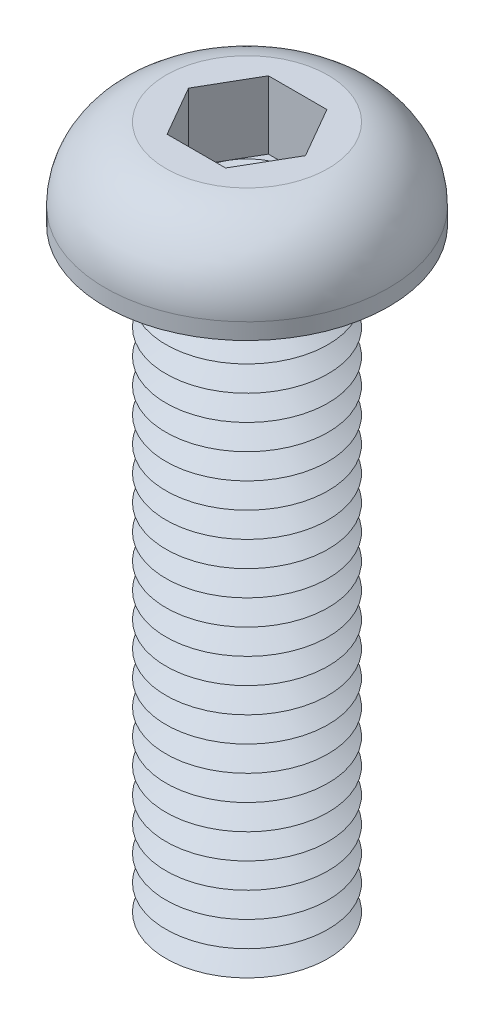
ISO-10303-21;
HEADER;
FILE_DESCRIPTION(('STEP AP214'),'2;1');
FILE_NAME('part.step','',(''),(''),'','','');
FILE_SCHEMA(('AUTOMOTIVE_DESIGN { 1 0 10303 214 1 1 1 1 }'));
ENDSEC;
DATA;
#1=APPLICATION_CONTEXT('core data for automotive mechanical design processes');
#2=APPLICATION_PROTOCOL_DEFINITION('international standard','automotive_design',2000,#1);
#3=PRODUCT_CONTEXT('',#1,'mechanical');
#4=PRODUCT('Part','Part','',(#3));
#5=PRODUCT_RELATED_PRODUCT_CATEGORY('part','',(#4));
#6=PRODUCT_DEFINITION_FORMATION('','',#4);
#7=PRODUCT_DEFINITION_CONTEXT('part definition',#1,'design');
#8=PRODUCT_DEFINITION('design','',#6,#7);
#9=PRODUCT_DEFINITION_SHAPE('','',#8);
#10=(LENGTH_UNIT() NAMED_UNIT(*) SI_UNIT(.MILLI.,.METRE.));
#11=(NAMED_UNIT(*) PLANE_ANGLE_UNIT() SI_UNIT($,.RADIAN.));
#12=(NAMED_UNIT(*) SI_UNIT($,.STERADIAN.) SOLID_ANGLE_UNIT());
#13=UNCERTAINTY_MEASURE_WITH_UNIT(LENGTH_MEASURE(1.E-05),#10,'distance_accuracy_value','');
#14=(GEOMETRIC_REPRESENTATION_CONTEXT(3) GLOBAL_UNCERTAINTY_ASSIGNED_CONTEXT((#13)) GLOBAL_UNIT_ASSIGNED_CONTEXT((#10,
#11,#12)) REPRESENTATION_CONTEXT('',''));
#15=CARTESIAN_POINT('',(0.,0.,0.));
#16=DIRECTION('',(0.,0.,1.));
#17=DIRECTION('',(1.,0.,0.));
#18=AXIS2_PLACEMENT_3D('',#15,#16,#17);
#19=CARTESIAN_POINT('',(0.,0.,0.));
#20=DIRECTION('',(0.,-1.,0.));
#21=DIRECTION('',(0.,0.,-1.));
#22=AXIS2_PLACEMENT_3D('',#19,#20,#21);
#23=TOROIDAL_SURFACE('',#22,4.625,0.625);
#24=CARTESIAN_POINT('',(0.,0.,-5.25));
#25=VERTEX_POINT('',#24);
#26=VERTEX_LOOP('',#25);
#27=FACE_BOUND('',#26,.T.);
#28=ADVANCED_FACE('P0_F12',(#27),#23,.T.);
#29=CLOSED_SHELL('',(#28));
#30=MANIFOLD_SOLID_BREP('P0_B1',#29);
#31=CARTESIAN_POINT('',(1.44337567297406,1.05,-2.5));
#32=DIRECTION('',(0.,1.,0.));
#33=DIRECTION('',(0.,0.,1.));
#34=AXIS2_PLACEMENT_3D('',#31,#32,#33);
#35=PLANE('',#34);
#36=CARTESIAN_POINT('',(0.,1.05,0.));
#37=DIRECTION('',(0.,1.,0.));
#38=DIRECTION('',(0.,0.,1.));
#39=AXIS2_PLACEMENT_3D('',#36,#37,#38);
#40=CIRCLE('',#39,2.5);
#41=CARTESIAN_POINT('',(0.,1.05,2.5));
#42=VERTEX_POINT('',#41);
#43=CARTESIAN_POINT('',(2.1650635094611,1.05,1.25));
#44=VERTEX_POINT('',#43);
#45=EDGE_CURVE('P1_E93',#42,#44,#40,.T.);
#46=ORIENTED_EDGE('',*,*,#45,.F.);
#47=DIRECTION('',(1.,0.,0.));
#48=VECTOR('',#47,1.);
#49=CARTESIAN_POINT('',(-1.44337567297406,1.05,2.5));
#50=LINE('',#49,#48);
#51=CARTESIAN_POINT('',(1.44337567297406,1.05,2.5));
#52=VERTEX_POINT('',#51);
#53=EDGE_CURVE('P1_E116',#42,#52,#50,.T.);
#54=ORIENTED_EDGE('',*,*,#53,.T.);
#55=DIRECTION('',(0.5,0.,-0.866025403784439));
#56=VECTOR('',#55,1.);
#57=CARTESIAN_POINT('',(1.44337567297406,1.05,2.5));
#58=LINE('',#57,#56);
#59=EDGE_CURVE('P1_E112',#52,#44,#58,.T.);
#60=ORIENTED_EDGE('',*,*,#59,.T.);
#61=EDGE_LOOP('',(#46,#54,#60));
#62=FACE_BOUND('',#61,.T.);
#63=ADVANCED_FACE('P1_F15',(#62),#35,.T.);
#64=CARTESIAN_POINT('',(0.,1.05,0.));
#65=DIRECTION('',(0.,1.,0.));
#66=DIRECTION('',(0.,0.,1.));
#67=AXIS2_PLACEMENT_3D('',#64,#65,#66);
#68=CIRCLE('',#67,2.5);
#69=CARTESIAN_POINT('',(2.1650635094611,1.05,-1.25));
#70=VERTEX_POINT('',#69);
#71=EDGE_CURVE('P1_E10',#44,#70,#68,.T.);
#72=ORIENTED_EDGE('',*,*,#71,.F.);
#73=CARTESIAN_POINT('',(2.88675134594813,1.05,0.));
#74=VERTEX_POINT('',#73);
#75=EDGE_CURVE('P1_E104',#44,#74,#58,.T.);
#76=ORIENTED_EDGE('',*,*,#75,.T.);
#77=DIRECTION('',(-0.5,0.,-0.866025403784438));
#78=VECTOR('',#77,1.);
#79=CARTESIAN_POINT('',(2.88675134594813,1.05,0.));
#80=LINE('',#79,#78);
#81=EDGE_CURVE('P1_E107',#74,#70,#80,.T.);
#82=ORIENTED_EDGE('',*,*,#81,.T.);
#83=EDGE_LOOP('',(#72,#76,#82));
#84=FACE_BOUND('',#83,.T.);
#85=ADVANCED_FACE('P1_F103',(#84),#35,.T.);
#86=CARTESIAN_POINT('',(0.,1.05,-2.5));
#87=VERTEX_POINT('',#86);
#88=EDGE_CURVE('P1_E24',#70,#87,#68,.T.);
#89=ORIENTED_EDGE('',*,*,#88,.F.);
#90=CARTESIAN_POINT('',(1.44337567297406,1.05,-2.5));
#91=VERTEX_POINT('',#90);
#92=EDGE_CURVE('P1_E139',#70,#91,#80,.T.);
#93=ORIENTED_EDGE('',*,*,#92,.T.);
#94=DIRECTION('',(-1.,0.,0.));
#95=VECTOR('',#94,1.);
#96=CARTESIAN_POINT('',(1.44337567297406,1.05,-2.5));
#97=LINE('',#96,#95);
#98=EDGE_CURVE('P1_E360',#91,#87,#97,.T.);
#99=ORIENTED_EDGE('',*,*,#98,.T.);
#100=EDGE_LOOP('',(#89,#93,#99));
#101=FACE_BOUND('',#100,.T.);
#102=ADVANCED_FACE('P1_F325',(#101),#35,.T.);
#103=CARTESIAN_POINT('',(-2.1650635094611,1.05,-1.25));
#104=VERTEX_POINT('',#103);
#105=EDGE_CURVE('P1_E355',#87,#104,#68,.T.);
#106=ORIENTED_EDGE('',*,*,#105,.F.);
#107=CARTESIAN_POINT('',(-1.44337567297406,1.05,-2.5));
#108=VERTEX_POINT('',#107);
#109=EDGE_CURVE('P1_E364',#87,#108,#97,.T.);
#110=ORIENTED_EDGE('',*,*,#109,.T.);
#111=DIRECTION('',(-0.5,0.,0.866025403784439));
#112=VECTOR('',#111,1.);
#113=CARTESIAN_POINT('',(-1.44337567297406,1.05,-2.5));
#114=LINE('',#113,#112);
#115=EDGE_CURVE('P1_E359',#108,#104,#114,.T.);
#116=ORIENTED_EDGE('',*,*,#115,.T.);
#117=EDGE_LOOP('',(#106,#110,#116));
#118=FACE_BOUND('',#117,.T.);
#119=ADVANCED_FACE('P1_F339',(#118),#35,.T.);
#120=CARTESIAN_POINT('',(-2.1650635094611,1.05,1.25));
#121=VERTEX_POINT('',#120);
#122=EDGE_CURVE('P1_E31',#104,#121,#68,.T.);
#123=ORIENTED_EDGE('',*,*,#122,.F.);
#124=CARTESIAN_POINT('',(-2.88675134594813,1.05,0.));
#125=VERTEX_POINT('',#124);
#126=EDGE_CURVE('P1_E351',#104,#125,#114,.T.);
#127=ORIENTED_EDGE('',*,*,#126,.T.);
#128=DIRECTION('',(0.5,0.,0.866025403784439));
#129=VECTOR('',#128,1.);
#130=CARTESIAN_POINT('',(-2.88675134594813,1.05,0.));
#131=LINE('',#130,#129);
#132=EDGE_CURVE('P1_E354',#125,#121,#131,.T.);
#133=ORIENTED_EDGE('',*,*,#132,.T.);
#134=EDGE_LOOP('',(#123,#127,#133));
#135=FACE_BOUND('',#134,.T.);
#136=ADVANCED_FACE('P1_F330',(#135),#35,.T.);
#137=CARTESIAN_POINT('',(0.,-28.75,0.));
#138=DIRECTION('',(0.,1.,0.));
#139=DIRECTION('',(0.,0.,1.));
#140=AXIS2_PLACEMENT_3D('',#137,#138,#139);
#141=CONICAL_SURFACE('',#140,2.91746824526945,1.0471975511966);
#142=CARTESIAN_POINT('',(0.,-28.125,0.));
#143=DIRECTION('',(0.,-1.,0.));
#144=DIRECTION('',(0.,0.,-1.));
#145=AXIS2_PLACEMENT_3D('',#142,#143,#144);
#146=CIRCLE('',#145,4.);
#147=CARTESIAN_POINT('',(0.,-28.125,-4.));
#148=VERTEX_POINT('',#147);
#149=EDGE_CURVE('P1_E287',#148,#148,#146,.T.);
#150=ORIENTED_EDGE('',*,*,#149,.T.);
#151=EDGE_LOOP('',(#150));
#152=FACE_BOUND('',#151,.T.);
#153=CARTESIAN_POINT('',(0.,-28.75,0.));
#154=DIRECTION('',(0.,-1.,0.));
#155=DIRECTION('',(0.,0.,-1.));
#156=AXIS2_PLACEMENT_3D('',#153,#154,#155);
#157=CIRCLE('',#156,2.91746824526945);
#158=CARTESIAN_POINT('',(0.,-28.75,-2.91746824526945));
#159=VERTEX_POINT('',#158);
#160=EDGE_CURVE('P1_E290',#159,#159,#157,.T.);
#161=ORIENTED_EDGE('',*,*,#160,.F.);
#162=EDGE_LOOP('',(#161));
#163=FACE_BOUND('',#162,.T.);
#164=ADVANCED_FACE('P1_F338',(#152,#163),#141,.T.);
#165=CARTESIAN_POINT('',(0.,-29.375,0.));
#166=DIRECTION('',(0.,-1.,0.));
#167=DIRECTION('',(0.,0.,-1.));
#168=AXIS2_PLACEMENT_3D('',#165,#166,#167);
#169=CONICAL_SURFACE('',#168,4.,1.0471975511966);
#170=ORIENTED_EDGE('',*,*,#160,.T.);
#171=EDGE_LOOP('',(#170));
#172=FACE_BOUND('',#171,.T.);
#173=CARTESIAN_POINT('',(0.,-29.375,0.));
#174=DIRECTION('',(0.,-1.,0.));
#175=DIRECTION('',(0.,0.,-1.));
#176=AXIS2_PLACEMENT_3D('',#173,#174,#175);
#177=CIRCLE('',#176,4.);
#178=CARTESIAN_POINT('',(0.,-29.375,-4.));
#179=VERTEX_POINT('',#178);
#180=EDGE_CURVE('P1_E293',#179,#179,#177,.T.);
#181=ORIENTED_EDGE('',*,*,#180,.F.);
#182=EDGE_LOOP('',(#181));
#183=FACE_BOUND('',#182,.T.);
#184=ADVANCED_FACE('P1_F345',(#172,#183),#169,.T.);
#185=CARTESIAN_POINT('',(0.,-30.,0.));
#186=DIRECTION('',(0.,1.,0.));
#187=DIRECTION('',(0.,0.,1.));
#188=AXIS2_PLACEMENT_3D('',#185,#186,#187);
#189=PLANE('',#188);
#190=CARTESIAN_POINT('',(0.,-30.,0.));
#191=DIRECTION('',(0.,-1.,0.));
#192=DIRECTION('',(0.,0.,-1.));
#193=AXIS2_PLACEMENT_3D('',#190,#191,#192);
#194=CIRCLE('',#193,2.91746824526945);
#195=CARTESIAN_POINT('',(0.,-30.,-2.91746824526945));
#196=VERTEX_POINT('',#195);
#197=EDGE_CURVE('P1_E296',#196,#196,#194,.T.);
#198=ORIENTED_EDGE('',*,*,#197,.T.);
#199=EDGE_LOOP('',(#198));
#200=FACE_BOUND('',#199,.T.);
#201=ADVANCED_FACE('P1_F423',(#200),#189,.F.);
#202=CARTESIAN_POINT('',(0.,-30.,0.));
#203=DIRECTION('',(0.,1.,0.));
#204=DIRECTION('',(0.,0.,1.));
#205=AXIS2_PLACEMENT_3D('',#202,#203,#204);
#206=CONICAL_SURFACE('',#205,2.91746824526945,1.0471975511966);
#207=ORIENTED_EDGE('',*,*,#180,.T.);
#208=EDGE_LOOP('',(#207));
#209=FACE_BOUND('',#208,.T.);
#210=ORIENTED_EDGE('',*,*,#197,.F.);
#211=EDGE_LOOP('',(#210));
#212=FACE_BOUND('',#211,.T.);
#213=ADVANCED_FACE('P1_F434',(#209,#212),#206,.T.);
#214=CARTESIAN_POINT('',(0.,-27.5,0.));
#215=DIRECTION('',(0.,1.,0.));
#216=DIRECTION('',(0.,0.,1.));
#217=AXIS2_PLACEMENT_3D('',#214,#215,#216);
#218=CONICAL_SURFACE('',#217,2.91746824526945,1.0471975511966);
#219=CARTESIAN_POINT('',(0.,-26.875,0.));
#220=DIRECTION('',(0.,-1.,0.));
#221=DIRECTION('',(0.,0.,-1.));
#222=AXIS2_PLACEMENT_3D('',#219,#220,#221);
#223=CIRCLE('',#222,4.);
#224=CARTESIAN_POINT('',(0.,-26.875,-4.));
#225=VERTEX_POINT('',#224);
#226=EDGE_CURVE('P1_E281',#225,#225,#223,.T.);
#227=ORIENTED_EDGE('',*,*,#226,.T.);
#228=EDGE_LOOP('',(#227));
#229=FACE_BOUND('',#228,.T.);
#230=CARTESIAN_POINT('',(0.,-27.5,0.));
#231=DIRECTION('',(0.,-1.,0.));
#232=DIRECTION('',(0.,0.,-1.));
#233=AXIS2_PLACEMENT_3D('',#230,#231,#232);
#234=CIRCLE('',#233,2.91746824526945);
#235=CARTESIAN_POINT('',(0.,-27.5,-2.91746824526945));
#236=VERTEX_POINT('',#235);
#237=EDGE_CURVE('P1_E284',#236,#236,#234,.T.);
#238=ORIENTED_EDGE('',*,*,#237,.F.);
#239=EDGE_LOOP('',(#238));
#240=FACE_BOUND('',#239,.T.);
#241=ADVANCED_FACE('P1_F443',(#229,#240),#218,.T.);
#242=CARTESIAN_POINT('',(0.,-28.125,0.));
#243=DIRECTION('',(0.,-1.,0.));
#244=DIRECTION('',(0.,0.,-1.));
#245=AXIS2_PLACEMENT_3D('',#242,#243,#244);
#246=CONICAL_SURFACE('',#245,4.,1.0471975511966);
#247=ORIENTED_EDGE('',*,*,#237,.T.);
#248=EDGE_LOOP('',(#247));
#249=FACE_BOUND('',#248,.T.);
#250=ORIENTED_EDGE('',*,*,#149,.F.);
#251=EDGE_LOOP('',(#250));
#252=FACE_BOUND('',#251,.T.);
#253=ADVANCED_FACE('P1_F452',(#249,#252),#246,.T.);
#254=CARTESIAN_POINT('',(0.,-26.25,0.));
#255=DIRECTION('',(0.,1.,0.));
#256=DIRECTION('',(0.,0.,1.));
#257=AXIS2_PLACEMENT_3D('',#254,#255,#256);
#258=CONICAL_SURFACE('',#257,2.91746824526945,1.0471975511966);
#259=CARTESIAN_POINT('',(0.,-25.625,0.));
#260=DIRECTION('',(0.,-1.,0.));
#261=DIRECTION('',(0.,0.,-1.));
#262=AXIS2_PLACEMENT_3D('',#259,#260,#261);
#263=CIRCLE('',#262,4.);
#264=CARTESIAN_POINT('',(0.,-25.625,-4.));
#265=VERTEX_POINT('',#264);
#266=EDGE_CURVE('P1_E275',#265,#265,#263,.T.);
#267=ORIENTED_EDGE('',*,*,#266,.T.);
#268=EDGE_LOOP('',(#267));
#269=FACE_BOUND('',#268,.T.);
#270=CARTESIAN_POINT('',(0.,-26.25,0.));
#271=DIRECTION('',(0.,-1.,0.));
#272=DIRECTION('',(0.,0.,-1.));
#273=AXIS2_PLACEMENT_3D('',#270,#271,#272);
#274=CIRCLE('',#273,2.91746824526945);
#275=CARTESIAN_POINT('',(0.,-26.25,-2.91746824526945));
#276=VERTEX_POINT('',#275);
#277=EDGE_CURVE('P1_E278',#276,#276,#274,.T.);
#278=ORIENTED_EDGE('',*,*,#277,.F.);
#279=EDGE_LOOP('',(#278));
#280=FACE_BOUND('',#279,.T.);
#281=ADVANCED_FACE('P1_F462',(#269,#280),#258,.T.);
#282=CARTESIAN_POINT('',(0.,-26.875,0.));
#283=DIRECTION('',(0.,-1.,0.));
#284=DIRECTION('',(0.,0.,-1.));
#285=AXIS2_PLACEMENT_3D('',#282,#283,#284);
#286=CONICAL_SURFACE('',#285,4.,1.0471975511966);
#287=ORIENTED_EDGE('',*,*,#277,.T.);
#288=EDGE_LOOP('',(#287));
#289=FACE_BOUND('',#288,.T.);
#290=ORIENTED_EDGE('',*,*,#226,.F.);
#291=EDGE_LOOP('',(#290));
#292=FACE_BOUND('',#291,.T.);
#293=ADVANCED_FACE('P1_F472',(#289,#292),#286,.T.);
#294=CARTESIAN_POINT('',(0.,-25.,0.));
#295=DIRECTION('',(0.,1.,0.));
#296=DIRECTION('',(0.,0.,1.));
#297=AXIS2_PLACEMENT_3D('',#294,#295,#296);
#298=CONICAL_SURFACE('',#297,2.91746824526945,1.0471975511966);
#299=CARTESIAN_POINT('',(0.,-24.375,0.));
#300=DIRECTION('',(0.,-1.,0.));
#301=DIRECTION('',(0.,0.,-1.));
#302=AXIS2_PLACEMENT_3D('',#299,#300,#301);
#303=CIRCLE('',#302,4.);
#304=CARTESIAN_POINT('',(0.,-24.375,-4.));
#305=VERTEX_POINT('',#304);
#306=EDGE_CURVE('P1_E269',#305,#305,#303,.T.);
#307=ORIENTED_EDGE('',*,*,#306,.T.);
#308=EDGE_LOOP('',(#307));
#309=FACE_BOUND('',#308,.T.);
#310=CARTESIAN_POINT('',(0.,-25.,0.));
#311=DIRECTION('',(0.,-1.,0.));
#312=DIRECTION('',(0.,0.,-1.));
#313=AXIS2_PLACEMENT_3D('',#310,#311,#312);
#314=CIRCLE('',#313,2.91746824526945);
#315=CARTESIAN_POINT('',(0.,-25.,-2.91746824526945));
#316=VERTEX_POINT('',#315);
#317=EDGE_CURVE('P1_E272',#316,#316,#314,.T.);
#318=ORIENTED_EDGE('',*,*,#317,.F.);
#319=EDGE_LOOP('',(#318));
#320=FACE_BOUND('',#319,.T.);
#321=ADVANCED_FACE('P1_F482',(#309,#320),#298,.T.);
#322=CARTESIAN_POINT('',(0.,-25.625,0.));
#323=DIRECTION('',(0.,-1.,0.));
#324=DIRECTION('',(0.,0.,-1.));
#325=AXIS2_PLACEMENT_3D('',#322,#323,#324);
#326=CONICAL_SURFACE('',#325,4.,1.0471975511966);
#327=ORIENTED_EDGE('',*,*,#317,.T.);
#328=EDGE_LOOP('',(#327));
#329=FACE_BOUND('',#328,.T.);
#330=ORIENTED_EDGE('',*,*,#266,.F.);
#331=EDGE_LOOP('',(#330));
#332=FACE_BOUND('',#331,.T.);
#333=ADVANCED_FACE('P1_F492',(#329,#332),#326,.T.);
#334=CARTESIAN_POINT('',(0.,-23.75,0.));
#335=DIRECTION('',(0.,1.,0.));
#336=DIRECTION('',(0.,0.,1.));
#337=AXIS2_PLACEMENT_3D('',#334,#335,#336);
#338=CONICAL_SURFACE('',#337,2.91746824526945,1.0471975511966);
#339=CARTESIAN_POINT('',(0.,-23.125,0.));
#340=DIRECTION('',(0.,-1.,0.));
#341=DIRECTION('',(0.,0.,-1.));
#342=AXIS2_PLACEMENT_3D('',#339,#340,#341);
#343=CIRCLE('',#342,4.);
#344=CARTESIAN_POINT('',(0.,-23.125,-4.));
#345=VERTEX_POINT('',#344);
#346=EDGE_CURVE('P1_E263',#345,#345,#343,.T.);
#347=ORIENTED_EDGE('',*,*,#346,.T.);
#348=EDGE_LOOP('',(#347));
#349=FACE_BOUND('',#348,.T.);
#350=CARTESIAN_POINT('',(0.,-23.75,0.));
#351=DIRECTION('',(0.,-1.,0.));
#352=DIRECTION('',(0.,0.,-1.));
#353=AXIS2_PLACEMENT_3D('',#350,#351,#352);
#354=CIRCLE('',#353,2.91746824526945);
#355=CARTESIAN_POINT('',(0.,-23.75,-2.91746824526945));
#356=VERTEX_POINT('',#355);
#357=EDGE_CURVE('P1_E266',#356,#356,#354,.T.);
#358=ORIENTED_EDGE('',*,*,#357,.F.);
#359=EDGE_LOOP('',(#358));
#360=FACE_BOUND('',#359,.T.);
#361=ADVANCED_FACE('P1_F502',(#349,#360),#338,.T.);
#362=CARTESIAN_POINT('',(0.,-24.375,0.));
#363=DIRECTION('',(0.,-1.,0.));
#364=DIRECTION('',(0.,0.,-1.));
#365=AXIS2_PLACEMENT_3D('',#362,#363,#364);
#366=CONICAL_SURFACE('',#365,4.,1.0471975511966);
#367=ORIENTED_EDGE('',*,*,#357,.T.);
#368=EDGE_LOOP('',(#367));
#369=FACE_BOUND('',#368,.T.);
#370=ORIENTED_EDGE('',*,*,#306,.F.);
#371=EDGE_LOOP('',(#370));
#372=FACE_BOUND('',#371,.T.);
#373=ADVANCED_FACE('P1_F512',(#369,#372),#366,.T.);
#374=CARTESIAN_POINT('',(0.,-22.5,0.));
#375=DIRECTION('',(0.,1.,0.));
#376=DIRECTION('',(0.,0.,1.));
#377=AXIS2_PLACEMENT_3D('',#374,#375,#376);
#378=CONICAL_SURFACE('',#377,2.91746824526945,1.0471975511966);
#379=CARTESIAN_POINT('',(0.,-21.875,0.));
#380=DIRECTION('',(0.,-1.,0.));
#381=DIRECTION('',(0.,0.,-1.));
#382=AXIS2_PLACEMENT_3D('',#379,#380,#381);
#383=CIRCLE('',#382,4.);
#384=CARTESIAN_POINT('',(0.,-21.875,-4.));
#385=VERTEX_POINT('',#384);
#386=EDGE_CURVE('P1_E257',#385,#385,#383,.T.);
#387=ORIENTED_EDGE('',*,*,#386,.T.);
#388=EDGE_LOOP('',(#387));
#389=FACE_BOUND('',#388,.T.);
#390=CARTESIAN_POINT('',(0.,-22.5,0.));
#391=DIRECTION('',(0.,-1.,0.));
#392=DIRECTION('',(0.,0.,-1.));
#393=AXIS2_PLACEMENT_3D('',#390,#391,#392);
#394=CIRCLE('',#393,2.91746824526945);
#395=CARTESIAN_POINT('',(0.,-22.5,-2.91746824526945));
#396=VERTEX_POINT('',#395);
#397=EDGE_CURVE('P1_E260',#396,#396,#394,.T.);
#398=ORIENTED_EDGE('',*,*,#397,.F.);
#399=EDGE_LOOP('',(#398));
#400=FACE_BOUND('',#399,.T.);
#401=ADVANCED_FACE('P1_F522',(#389,#400),#378,.T.);
#402=CARTESIAN_POINT('',(0.,-23.125,0.));
#403=DIRECTION('',(0.,-1.,0.));
#404=DIRECTION('',(0.,0.,-1.));
#405=AXIS2_PLACEMENT_3D('',#402,#403,#404);
#406=CONICAL_SURFACE('',#405,4.,1.0471975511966);
#407=ORIENTED_EDGE('',*,*,#397,.T.);
#408=EDGE_LOOP('',(#407));
#409=FACE_BOUND('',#408,.T.);
#410=ORIENTED_EDGE('',*,*,#346,.F.);
#411=EDGE_LOOP('',(#410));
#412=FACE_BOUND('',#411,.T.);
#413=ADVANCED_FACE('P1_F532',(#409,#412),#406,.T.);
#414=CARTESIAN_POINT('',(0.,-21.25,0.));
#415=DIRECTION('',(0.,1.,0.));
#416=DIRECTION('',(0.,0.,1.));
#417=AXIS2_PLACEMENT_3D('',#414,#415,#416);
#418=CONICAL_SURFACE('',#417,2.91746824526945,1.0471975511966);
#419=CARTESIAN_POINT('',(0.,-20.625,0.));
#420=DIRECTION('',(0.,-1.,0.));
#421=DIRECTION('',(0.,0.,-1.));
#422=AXIS2_PLACEMENT_3D('',#419,#420,#421);
#423=CIRCLE('',#422,4.);
#424=CARTESIAN_POINT('',(0.,-20.625,-4.));
#425=VERTEX_POINT('',#424);
#426=EDGE_CURVE('P1_E251',#425,#425,#423,.T.);
#427=ORIENTED_EDGE('',*,*,#426,.T.);
#428=EDGE_LOOP('',(#427));
#429=FACE_BOUND('',#428,.T.);
#430=CARTESIAN_POINT('',(0.,-21.25,0.));
#431=DIRECTION('',(0.,-1.,0.));
#432=DIRECTION('',(0.,0.,-1.));
#433=AXIS2_PLACEMENT_3D('',#430,#431,#432);
#434=CIRCLE('',#433,2.91746824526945);
#435=CARTESIAN_POINT('',(0.,-21.25,-2.91746824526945));
#436=VERTEX_POINT('',#435);
#437=EDGE_CURVE('P1_E254',#436,#436,#434,.T.);
#438=ORIENTED_EDGE('',*,*,#437,.F.);
#439=EDGE_LOOP('',(#438));
#440=FACE_BOUND('',#439,.T.);
#441=ADVANCED_FACE('P1_F542',(#429,#440),#418,.T.);
#442=CARTESIAN_POINT('',(0.,-21.875,0.));
#443=DIRECTION('',(0.,-1.,0.));
#444=DIRECTION('',(0.,0.,-1.));
#445=AXIS2_PLACEMENT_3D('',#442,#443,#444);
#446=CONICAL_SURFACE('',#445,4.,1.0471975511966);
#447=ORIENTED_EDGE('',*,*,#437,.T.);
#448=EDGE_LOOP('',(#447));
#449=FACE_BOUND('',#448,.T.);
#450=ORIENTED_EDGE('',*,*,#386,.F.);
#451=EDGE_LOOP('',(#450));
#452=FACE_BOUND('',#451,.T.);
#453=ADVANCED_FACE('P1_F552',(#449,#452),#446,.T.);
#454=CARTESIAN_POINT('',(0.,-20.,0.));
#455=DIRECTION('',(0.,1.,0.));
#456=DIRECTION('',(0.,0.,1.));
#457=AXIS2_PLACEMENT_3D('',#454,#455,#456);
#458=CONICAL_SURFACE('',#457,2.91746824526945,1.0471975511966);
#459=CARTESIAN_POINT('',(0.,-19.375,0.));
#460=DIRECTION('',(0.,-1.,0.));
#461=DIRECTION('',(0.,0.,-1.));
#462=AXIS2_PLACEMENT_3D('',#459,#460,#461);
#463=CIRCLE('',#462,4.);
#464=CARTESIAN_POINT('',(0.,-19.375,-4.));
#465=VERTEX_POINT('',#464);
#466=EDGE_CURVE('P1_E245',#465,#465,#463,.T.);
#467=ORIENTED_EDGE('',*,*,#466,.T.);
#468=EDGE_LOOP('',(#467));
#469=FACE_BOUND('',#468,.T.);
#470=CARTESIAN_POINT('',(0.,-20.,0.));
#471=DIRECTION('',(0.,-1.,0.));
#472=DIRECTION('',(0.,0.,-1.));
#473=AXIS2_PLACEMENT_3D('',#470,#471,#472);
#474=CIRCLE('',#473,2.91746824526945);
#475=CARTESIAN_POINT('',(0.,-20.,-2.91746824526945));
#476=VERTEX_POINT('',#475);
#477=EDGE_CURVE('P1_E248',#476,#476,#474,.T.);
#478=ORIENTED_EDGE('',*,*,#477,.F.);
#479=EDGE_LOOP('',(#478));
#480=FACE_BOUND('',#479,.T.);
#481=ADVANCED_FACE('P1_F562',(#469,#480),#458,.T.);
#482=CARTESIAN_POINT('',(0.,-20.625,0.));
#483=DIRECTION('',(0.,-1.,0.));
#484=DIRECTION('',(0.,0.,-1.));
#485=AXIS2_PLACEMENT_3D('',#482,#483,#484);
#486=CONICAL_SURFACE('',#485,4.,1.0471975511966);
#487=ORIENTED_EDGE('',*,*,#477,.T.);
#488=EDGE_LOOP('',(#487));
#489=FACE_BOUND('',#488,.T.);
#490=ORIENTED_EDGE('',*,*,#426,.F.);
#491=EDGE_LOOP('',(#490));
#492=FACE_BOUND('',#491,.T.);
#493=ADVANCED_FACE('P1_F572',(#489,#492),#486,.T.);
#494=CARTESIAN_POINT('',(0.,-18.75,0.));
#495=DIRECTION('',(0.,1.,0.));
#496=DIRECTION('',(0.,0.,1.));
#497=AXIS2_PLACEMENT_3D('',#494,#495,#496);
#498=CONICAL_SURFACE('',#497,2.91746824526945,1.0471975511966);
#499=CARTESIAN_POINT('',(0.,-18.125,0.));
#500=DIRECTION('',(0.,-1.,0.));
#501=DIRECTION('',(0.,0.,-1.));
#502=AXIS2_PLACEMENT_3D('',#499,#500,#501);
#503=CIRCLE('',#502,4.);
#504=CARTESIAN_POINT('',(0.,-18.125,-4.));
#505=VERTEX_POINT('',#504);
#506=EDGE_CURVE('P1_E239',#505,#505,#503,.T.);
#507=ORIENTED_EDGE('',*,*,#506,.T.);
#508=EDGE_LOOP('',(#507));
#509=FACE_BOUND('',#508,.T.);
#510=CARTESIAN_POINT('',(0.,-18.75,0.));
#511=DIRECTION('',(0.,-1.,0.));
#512=DIRECTION('',(0.,0.,-1.));
#513=AXIS2_PLACEMENT_3D('',#510,#511,#512);
#514=CIRCLE('',#513,2.91746824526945);
#515=CARTESIAN_POINT('',(0.,-18.75,-2.91746824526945));
#516=VERTEX_POINT('',#515);
#517=EDGE_CURVE('P1_E242',#516,#516,#514,.T.);
#518=ORIENTED_EDGE('',*,*,#517,.F.);
#519=EDGE_LOOP('',(#518));
#520=FACE_BOUND('',#519,.T.);
#521=ADVANCED_FACE('P1_F582',(#509,#520),#498,.T.);
#522=CARTESIAN_POINT('',(0.,-19.375,0.));
#523=DIRECTION('',(0.,-1.,0.));
#524=DIRECTION('',(0.,0.,-1.));
#525=AXIS2_PLACEMENT_3D('',#522,#523,#524);
#526=CONICAL_SURFACE('',#525,4.,1.0471975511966);
#527=ORIENTED_EDGE('',*,*,#517,.T.);
#528=EDGE_LOOP('',(#527));
#529=FACE_BOUND('',#528,.T.);
#530=ORIENTED_EDGE('',*,*,#466,.F.);
#531=EDGE_LOOP('',(#530));
#532=FACE_BOUND('',#531,.T.);
#533=ADVANCED_FACE('P1_F592',(#529,#532),#526,.T.);
#534=CARTESIAN_POINT('',(0.,-17.5,0.));
#535=DIRECTION('',(0.,1.,0.));
#536=DIRECTION('',(0.,0.,1.));
#537=AXIS2_PLACEMENT_3D('',#534,#535,#536);
#538=CONICAL_SURFACE('',#537,2.91746824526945,1.0471975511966);
#539=CARTESIAN_POINT('',(0.,-16.875,0.));
#540=DIRECTION('',(0.,-1.,0.));
#541=DIRECTION('',(0.,0.,-1.));
#542=AXIS2_PLACEMENT_3D('',#539,#540,#541);
#543=CIRCLE('',#542,4.);
#544=CARTESIAN_POINT('',(0.,-16.875,-4.));
#545=VERTEX_POINT('',#544);
#546=EDGE_CURVE('P1_E233',#545,#545,#543,.T.);
#547=ORIENTED_EDGE('',*,*,#546,.T.);
#548=EDGE_LOOP('',(#547));
#549=FACE_BOUND('',#548,.T.);
#550=CARTESIAN_POINT('',(0.,-17.5,0.));
#551=DIRECTION('',(0.,-1.,0.));
#552=DIRECTION('',(0.,0.,-1.));
#553=AXIS2_PLACEMENT_3D('',#550,#551,#552);
#554=CIRCLE('',#553,2.91746824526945);
#555=CARTESIAN_POINT('',(0.,-17.5,-2.91746824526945));
#556=VERTEX_POINT('',#555);
#557=EDGE_CURVE('P1_E236',#556,#556,#554,.T.);
#558=ORIENTED_EDGE('',*,*,#557,.F.);
#559=EDGE_LOOP('',(#558));
#560=FACE_BOUND('',#559,.T.);
#561=ADVANCED_FACE('P1_F602',(#549,#560),#538,.T.);
#562=CARTESIAN_POINT('',(0.,-18.125,0.));
#563=DIRECTION('',(0.,-1.,0.));
#564=DIRECTION('',(0.,0.,-1.));
#565=AXIS2_PLACEMENT_3D('',#562,#563,#564);
#566=CONICAL_SURFACE('',#565,4.,1.0471975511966);
#567=ORIENTED_EDGE('',*,*,#557,.T.);
#568=EDGE_LOOP('',(#567));
#569=FACE_BOUND('',#568,.T.);
#570=ORIENTED_EDGE('',*,*,#506,.F.);
#571=EDGE_LOOP('',(#570));
#572=FACE_BOUND('',#571,.T.);
#573=ADVANCED_FACE('P1_F612',(#569,#572),#566,.T.);
#574=CARTESIAN_POINT('',(0.,-16.25,0.));
#575=DIRECTION('',(0.,1.,0.));
#576=DIRECTION('',(0.,0.,1.));
#577=AXIS2_PLACEMENT_3D('',#574,#575,#576);
#578=CONICAL_SURFACE('',#577,2.91746824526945,1.0471975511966);
#579=CARTESIAN_POINT('',(0.,-15.625,0.));
#580=DIRECTION('',(0.,-1.,0.));
#581=DIRECTION('',(0.,0.,-1.));
#582=AXIS2_PLACEMENT_3D('',#579,#580,#581);
#583=CIRCLE('',#582,4.);
#584=CARTESIAN_POINT('',(0.,-15.625,-4.));
#585=VERTEX_POINT('',#584);
#586=EDGE_CURVE('P1_E227',#585,#585,#583,.T.);
#587=ORIENTED_EDGE('',*,*,#586,.T.);
#588=EDGE_LOOP('',(#587));
#589=FACE_BOUND('',#588,.T.);
#590=CARTESIAN_POINT('',(0.,-16.25,0.));
#591=DIRECTION('',(0.,-1.,0.));
#592=DIRECTION('',(0.,0.,-1.));
#593=AXIS2_PLACEMENT_3D('',#590,#591,#592);
#594=CIRCLE('',#593,2.91746824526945);
#595=CARTESIAN_POINT('',(0.,-16.25,-2.91746824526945));
#596=VERTEX_POINT('',#595);
#597=EDGE_CURVE('P1_E230',#596,#596,#594,.T.);
#598=ORIENTED_EDGE('',*,*,#597,.F.);
#599=EDGE_LOOP('',(#598));
#600=FACE_BOUND('',#599,.T.);
#601=ADVANCED_FACE('P1_F622',(#589,#600),#578,.T.);
#602=CARTESIAN_POINT('',(0.,-16.875,0.));
#603=DIRECTION('',(0.,-1.,0.));
#604=DIRECTION('',(0.,0.,-1.));
#605=AXIS2_PLACEMENT_3D('',#602,#603,#604);
#606=CONICAL_SURFACE('',#605,4.,1.0471975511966);
#607=ORIENTED_EDGE('',*,*,#597,.T.);
#608=EDGE_LOOP('',(#607));
#609=FACE_BOUND('',#608,.T.);
#610=ORIENTED_EDGE('',*,*,#546,.F.);
#611=EDGE_LOOP('',(#610));
#612=FACE_BOUND('',#611,.T.);
#613=ADVANCED_FACE('P1_F632',(#609,#612),#606,.T.);
#614=CARTESIAN_POINT('',(0.,-15.,0.));
#615=DIRECTION('',(0.,1.,0.));
#616=DIRECTION('',(0.,0.,1.));
#617=AXIS2_PLACEMENT_3D('',#614,#615,#616);
#618=CONICAL_SURFACE('',#617,2.91746824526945,1.0471975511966);
#619=CARTESIAN_POINT('',(0.,-14.375,0.));
#620=DIRECTION('',(0.,-1.,0.));
#621=DIRECTION('',(0.,0.,-1.));
#622=AXIS2_PLACEMENT_3D('',#619,#620,#621);
#623=CIRCLE('',#622,4.);
#624=CARTESIAN_POINT('',(0.,-14.375,-4.));
#625=VERTEX_POINT('',#624);
#626=EDGE_CURVE('P1_E221',#625,#625,#623,.T.);
#627=ORIENTED_EDGE('',*,*,#626,.T.);
#628=EDGE_LOOP('',(#627));
#629=FACE_BOUND('',#628,.T.);
#630=CARTESIAN_POINT('',(0.,-15.,0.));
#631=DIRECTION('',(0.,-1.,0.));
#632=DIRECTION('',(0.,0.,-1.));
#633=AXIS2_PLACEMENT_3D('',#630,#631,#632);
#634=CIRCLE('',#633,2.91746824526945);
#635=CARTESIAN_POINT('',(0.,-15.,-2.91746824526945));
#636=VERTEX_POINT('',#635);
#637=EDGE_CURVE('P1_E224',#636,#636,#634,.T.);
#638=ORIENTED_EDGE('',*,*,#637,.F.);
#639=EDGE_LOOP('',(#638));
#640=FACE_BOUND('',#639,.T.);
#641=ADVANCED_FACE('P1_F642',(#629,#640),#618,.T.);
#642=CARTESIAN_POINT('',(0.,-15.625,0.));
#643=DIRECTION('',(0.,-1.,0.));
#644=DIRECTION('',(0.,0.,-1.));
#645=AXIS2_PLACEMENT_3D('',#642,#643,#644);
#646=CONICAL_SURFACE('',#645,4.,1.0471975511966);
#647=ORIENTED_EDGE('',*,*,#637,.T.);
#648=EDGE_LOOP('',(#647));
#649=FACE_BOUND('',#648,.T.);
#650=ORIENTED_EDGE('',*,*,#586,.F.);
#651=EDGE_LOOP('',(#650));
#652=FACE_BOUND('',#651,.T.);
#653=ADVANCED_FACE('P1_F652',(#649,#652),#646,.T.);
#654=CARTESIAN_POINT('',(0.,-13.75,0.));
#655=DIRECTION('',(0.,1.,0.));
#656=DIRECTION('',(0.,0.,1.));
#657=AXIS2_PLACEMENT_3D('',#654,#655,#656);
#658=CONICAL_SURFACE('',#657,2.91746824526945,1.0471975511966);
#659=CARTESIAN_POINT('',(0.,-13.125,0.));
#660=DIRECTION('',(0.,-1.,0.));
#661=DIRECTION('',(0.,0.,-1.));
#662=AXIS2_PLACEMENT_3D('',#659,#660,#661);
#663=CIRCLE('',#662,4.);
#664=CARTESIAN_POINT('',(0.,-13.125,-4.));
#665=VERTEX_POINT('',#664);
#666=EDGE_CURVE('P1_E215',#665,#665,#663,.T.);
#667=ORIENTED_EDGE('',*,*,#666,.T.);
#668=EDGE_LOOP('',(#667));
#669=FACE_BOUND('',#668,.T.);
#670=CARTESIAN_POINT('',(0.,-13.75,0.));
#671=DIRECTION('',(0.,-1.,0.));
#672=DIRECTION('',(0.,0.,-1.));
#673=AXIS2_PLACEMENT_3D('',#670,#671,#672);
#674=CIRCLE('',#673,2.91746824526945);
#675=CARTESIAN_POINT('',(0.,-13.75,-2.91746824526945));
#676=VERTEX_POINT('',#675);
#677=EDGE_CURVE('P1_E218',#676,#676,#674,.T.);
#678=ORIENTED_EDGE('',*,*,#677,.F.);
#679=EDGE_LOOP('',(#678));
#680=FACE_BOUND('',#679,.T.);
#681=ADVANCED_FACE('P1_F662',(#669,#680),#658,.T.);
#682=CARTESIAN_POINT('',(0.,-14.375,0.));
#683=DIRECTION('',(0.,-1.,0.));
#684=DIRECTION('',(0.,0.,-1.));
#685=AXIS2_PLACEMENT_3D('',#682,#683,#684);
#686=CONICAL_SURFACE('',#685,4.,1.0471975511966);
#687=ORIENTED_EDGE('',*,*,#677,.T.);
#688=EDGE_LOOP('',(#687));
#689=FACE_BOUND('',#688,.T.);
#690=ORIENTED_EDGE('',*,*,#626,.F.);
#691=EDGE_LOOP('',(#690));
#692=FACE_BOUND('',#691,.T.);
#693=ADVANCED_FACE('P1_F672',(#689,#692),#686,.T.);
#694=CARTESIAN_POINT('',(0.,-12.5,0.));
#695=DIRECTION('',(0.,1.,0.));
#696=DIRECTION('',(0.,0.,1.));
#697=AXIS2_PLACEMENT_3D('',#694,#695,#696);
#698=CONICAL_SURFACE('',#697,2.91746824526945,1.0471975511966);
#699=CARTESIAN_POINT('',(0.,-11.875,0.));
#700=DIRECTION('',(0.,-1.,0.));
#701=DIRECTION('',(0.,0.,-1.));
#702=AXIS2_PLACEMENT_3D('',#699,#700,#701);
#703=CIRCLE('',#702,4.);
#704=CARTESIAN_POINT('',(0.,-11.875,-4.));
#705=VERTEX_POINT('',#704);
#706=EDGE_CURVE('P1_E209',#705,#705,#703,.T.);
#707=ORIENTED_EDGE('',*,*,#706,.T.);
#708=EDGE_LOOP('',(#707));
#709=FACE_BOUND('',#708,.T.);
#710=CARTESIAN_POINT('',(0.,-12.5,0.));
#711=DIRECTION('',(0.,-1.,0.));
#712=DIRECTION('',(0.,0.,-1.));
#713=AXIS2_PLACEMENT_3D('',#710,#711,#712);
#714=CIRCLE('',#713,2.91746824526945);
#715=CARTESIAN_POINT('',(0.,-12.5,-2.91746824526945));
#716=VERTEX_POINT('',#715);
#717=EDGE_CURVE('P1_E212',#716,#716,#714,.T.);
#718=ORIENTED_EDGE('',*,*,#717,.F.);
#719=EDGE_LOOP('',(#718));
#720=FACE_BOUND('',#719,.T.);
#721=ADVANCED_FACE('P1_F682',(#709,#720),#698,.T.);
#722=CARTESIAN_POINT('',(0.,-13.125,0.));
#723=DIRECTION('',(0.,-1.,0.));
#724=DIRECTION('',(0.,0.,-1.));
#725=AXIS2_PLACEMENT_3D('',#722,#723,#724);
#726=CONICAL_SURFACE('',#725,4.,1.0471975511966);
#727=ORIENTED_EDGE('',*,*,#717,.T.);
#728=EDGE_LOOP('',(#727));
#729=FACE_BOUND('',#728,.T.);
#730=ORIENTED_EDGE('',*,*,#666,.F.);
#731=EDGE_LOOP('',(#730));
#732=FACE_BOUND('',#731,.T.);
#733=ADVANCED_FACE('P1_F692',(#729,#732),#726,.T.);
#734=CARTESIAN_POINT('',(0.,-11.25,0.));
#735=DIRECTION('',(0.,1.,0.));
#736=DIRECTION('',(0.,0.,1.));
#737=AXIS2_PLACEMENT_3D('',#734,#735,#736);
#738=CONICAL_SURFACE('',#737,2.91746824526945,1.0471975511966);
#739=CARTESIAN_POINT('',(0.,-10.625,0.));
#740=DIRECTION('',(0.,-1.,0.));
#741=DIRECTION('',(0.,0.,-1.));
#742=AXIS2_PLACEMENT_3D('',#739,#740,#741);
#743=CIRCLE('',#742,4.);
#744=CARTESIAN_POINT('',(0.,-10.625,-4.));
#745=VERTEX_POINT('',#744);
#746=EDGE_CURVE('P1_E203',#745,#745,#743,.T.);
#747=ORIENTED_EDGE('',*,*,#746,.T.);
#748=EDGE_LOOP('',(#747));
#749=FACE_BOUND('',#748,.T.);
#750=CARTESIAN_POINT('',(0.,-11.25,0.));
#751=DIRECTION('',(0.,-1.,0.));
#752=DIRECTION('',(0.,0.,-1.));
#753=AXIS2_PLACEMENT_3D('',#750,#751,#752);
#754=CIRCLE('',#753,2.91746824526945);
#755=CARTESIAN_POINT('',(0.,-11.25,-2.91746824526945));
#756=VERTEX_POINT('',#755);
#757=EDGE_CURVE('P1_E206',#756,#756,#754,.T.);
#758=ORIENTED_EDGE('',*,*,#757,.F.);
#759=EDGE_LOOP('',(#758));
#760=FACE_BOUND('',#759,.T.);
#761=ADVANCED_FACE('P1_F702',(#749,#760),#738,.T.);
#762=CARTESIAN_POINT('',(0.,-11.875,0.));
#763=DIRECTION('',(0.,-1.,0.));
#764=DIRECTION('',(0.,0.,-1.));
#765=AXIS2_PLACEMENT_3D('',#762,#763,#764);
#766=CONICAL_SURFACE('',#765,4.,1.0471975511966);
#767=ORIENTED_EDGE('',*,*,#757,.T.);
#768=EDGE_LOOP('',(#767));
#769=FACE_BOUND('',#768,.T.);
#770=ORIENTED_EDGE('',*,*,#706,.F.);
#771=EDGE_LOOP('',(#770));
#772=FACE_BOUND('',#771,.T.);
#773=ADVANCED_FACE('P1_F712',(#769,#772),#766,.T.);
#774=CARTESIAN_POINT('',(0.,-10.,0.));
#775=DIRECTION('',(0.,1.,0.));
#776=DIRECTION('',(0.,0.,1.));
#777=AXIS2_PLACEMENT_3D('',#774,#775,#776);
#778=CONICAL_SURFACE('',#777,2.91746824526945,1.0471975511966);
#779=CARTESIAN_POINT('',(0.,-9.375,0.));
#780=DIRECTION('',(0.,-1.,0.));
#781=DIRECTION('',(0.,0.,-1.));
#782=AXIS2_PLACEMENT_3D('',#779,#780,#781);
#783=CIRCLE('',#782,4.);
#784=CARTESIAN_POINT('',(0.,-9.375,-4.));
#785=VERTEX_POINT('',#784);
#786=EDGE_CURVE('P1_E197',#785,#785,#783,.T.);
#787=ORIENTED_EDGE('',*,*,#786,.T.);
#788=EDGE_LOOP('',(#787));
#789=FACE_BOUND('',#788,.T.);
#790=CARTESIAN_POINT('',(0.,-10.,0.));
#791=DIRECTION('',(0.,-1.,0.));
#792=DIRECTION('',(0.,0.,-1.));
#793=AXIS2_PLACEMENT_3D('',#790,#791,#792);
#794=CIRCLE('',#793,2.91746824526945);
#795=CARTESIAN_POINT('',(0.,-10.,-2.91746824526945));
#796=VERTEX_POINT('',#795);
#797=EDGE_CURVE('P1_E200',#796,#796,#794,.T.);
#798=ORIENTED_EDGE('',*,*,#797,.F.);
#799=EDGE_LOOP('',(#798));
#800=FACE_BOUND('',#799,.T.);
#801=ADVANCED_FACE('P1_F722',(#789,#800),#778,.T.);
#802=CARTESIAN_POINT('',(0.,-10.625,0.));
#803=DIRECTION('',(0.,-1.,0.));
#804=DIRECTION('',(0.,0.,-1.));
#805=AXIS2_PLACEMENT_3D('',#802,#803,#804);
#806=CONICAL_SURFACE('',#805,4.,1.0471975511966);
#807=ORIENTED_EDGE('',*,*,#797,.T.);
#808=EDGE_LOOP('',(#807));
#809=FACE_BOUND('',#808,.T.);
#810=ORIENTED_EDGE('',*,*,#746,.F.);
#811=EDGE_LOOP('',(#810));
#812=FACE_BOUND('',#811,.T.);
#813=ADVANCED_FACE('P1_F732',(#809,#812),#806,.T.);
#814=CARTESIAN_POINT('',(0.,-8.75,0.));
#815=DIRECTION('',(0.,1.,0.));
#816=DIRECTION('',(0.,0.,1.));
#817=AXIS2_PLACEMENT_3D('',#814,#815,#816);
#818=CONICAL_SURFACE('',#817,2.91746824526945,1.0471975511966);
#819=CARTESIAN_POINT('',(0.,-8.125,0.));
#820=DIRECTION('',(0.,-1.,0.));
#821=DIRECTION('',(0.,0.,-1.));
#822=AXIS2_PLACEMENT_3D('',#819,#820,#821);
#823=CIRCLE('',#822,4.);
#824=CARTESIAN_POINT('',(0.,-8.125,-4.));
#825=VERTEX_POINT('',#824);
#826=EDGE_CURVE('P1_E191',#825,#825,#823,.T.);
#827=ORIENTED_EDGE('',*,*,#826,.T.);
#828=EDGE_LOOP('',(#827));
#829=FACE_BOUND('',#828,.T.);
#830=CARTESIAN_POINT('',(0.,-8.75,0.));
#831=DIRECTION('',(0.,-1.,0.));
#832=DIRECTION('',(0.,0.,-1.));
#833=AXIS2_PLACEMENT_3D('',#830,#831,#832);
#834=CIRCLE('',#833,2.91746824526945);
#835=CARTESIAN_POINT('',(0.,-8.75,-2.91746824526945));
#836=VERTEX_POINT('',#835);
#837=EDGE_CURVE('P1_E194',#836,#836,#834,.T.);
#838=ORIENTED_EDGE('',*,*,#837,.F.);
#839=EDGE_LOOP('',(#838));
#840=FACE_BOUND('',#839,.T.);
#841=ADVANCED_FACE('P1_F742',(#829,#840),#818,.T.);
#842=CARTESIAN_POINT('',(0.,-9.375,0.));
#843=DIRECTION('',(0.,-1.,0.));
#844=DIRECTION('',(0.,0.,-1.));
#845=AXIS2_PLACEMENT_3D('',#842,#843,#844);
#846=CONICAL_SURFACE('',#845,4.,1.0471975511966);
#847=ORIENTED_EDGE('',*,*,#837,.T.);
#848=EDGE_LOOP('',(#847));
#849=FACE_BOUND('',#848,.T.);
#850=ORIENTED_EDGE('',*,*,#786,.F.);
#851=EDGE_LOOP('',(#850));
#852=FACE_BOUND('',#851,.T.);
#853=ADVANCED_FACE('P1_F752',(#849,#852),#846,.T.);
#854=CARTESIAN_POINT('',(0.,-7.5,0.));
#855=DIRECTION('',(0.,1.,0.));
#856=DIRECTION('',(0.,0.,1.));
#857=AXIS2_PLACEMENT_3D('',#854,#855,#856);
#858=CONICAL_SURFACE('',#857,2.91746824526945,1.0471975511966);
#859=CARTESIAN_POINT('',(0.,-6.875,0.));
#860=DIRECTION('',(0.,-1.,0.));
#861=DIRECTION('',(0.,0.,-1.));
#862=AXIS2_PLACEMENT_3D('',#859,#860,#861);
#863=CIRCLE('',#862,4.);
#864=CARTESIAN_POINT('',(0.,-6.875,-4.));
#865=VERTEX_POINT('',#864);
#866=EDGE_CURVE('P1_E185',#865,#865,#863,.T.);
#867=ORIENTED_EDGE('',*,*,#866,.T.);
#868=EDGE_LOOP('',(#867));
#869=FACE_BOUND('',#868,.T.);
#870=CARTESIAN_POINT('',(0.,-7.5,0.));
#871=DIRECTION('',(0.,-1.,0.));
#872=DIRECTION('',(0.,0.,-1.));
#873=AXIS2_PLACEMENT_3D('',#870,#871,#872);
#874=CIRCLE('',#873,2.91746824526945);
#875=CARTESIAN_POINT('',(0.,-7.5,-2.91746824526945));
#876=VERTEX_POINT('',#875);
#877=EDGE_CURVE('P1_E188',#876,#876,#874,.T.);
#878=ORIENTED_EDGE('',*,*,#877,.F.);
#879=EDGE_LOOP('',(#878));
#880=FACE_BOUND('',#879,.T.);
#881=ADVANCED_FACE('P1_F762',(#869,#880),#858,.T.);
#882=CARTESIAN_POINT('',(0.,-8.125,0.));
#883=DIRECTION('',(0.,-1.,0.));
#884=DIRECTION('',(0.,0.,-1.));
#885=AXIS2_PLACEMENT_3D('',#882,#883,#884);
#886=CONICAL_SURFACE('',#885,4.,1.0471975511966);
#887=ORIENTED_EDGE('',*,*,#877,.T.);
#888=EDGE_LOOP('',(#887));
#889=FACE_BOUND('',#888,.T.);
#890=ORIENTED_EDGE('',*,*,#826,.F.);
#891=EDGE_LOOP('',(#890));
#892=FACE_BOUND('',#891,.T.);
#893=ADVANCED_FACE('P1_F772',(#889,#892),#886,.T.);
#894=CARTESIAN_POINT('',(0.,-6.25,0.));
#895=DIRECTION('',(0.,1.,0.));
#896=DIRECTION('',(0.,0.,1.));
#897=AXIS2_PLACEMENT_3D('',#894,#895,#896);
#898=CONICAL_SURFACE('',#897,2.91746824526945,1.0471975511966);
#899=CARTESIAN_POINT('',(0.,-5.625,0.));
#900=DIRECTION('',(0.,-1.,0.));
#901=DIRECTION('',(0.,0.,-1.));
#902=AXIS2_PLACEMENT_3D('',#899,#900,#901);
#903=CIRCLE('',#902,4.);
#904=CARTESIAN_POINT('',(0.,-5.625,-4.));
#905=VERTEX_POINT('',#904);
#906=EDGE_CURVE('P1_E179',#905,#905,#903,.T.);
#907=ORIENTED_EDGE('',*,*,#906,.T.);
#908=EDGE_LOOP('',(#907));
#909=FACE_BOUND('',#908,.T.);
#910=CARTESIAN_POINT('',(0.,-6.25,0.));
#911=DIRECTION('',(0.,-1.,0.));
#912=DIRECTION('',(0.,0.,-1.));
#913=AXIS2_PLACEMENT_3D('',#910,#911,#912);
#914=CIRCLE('',#913,2.91746824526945);
#915=CARTESIAN_POINT('',(0.,-6.25,-2.91746824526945));
#916=VERTEX_POINT('',#915);
#917=EDGE_CURVE('P1_E182',#916,#916,#914,.T.);
#918=ORIENTED_EDGE('',*,*,#917,.F.);
#919=EDGE_LOOP('',(#918));
#920=FACE_BOUND('',#919,.T.);
#921=ADVANCED_FACE('P1_F782',(#909,#920),#898,.T.);
#922=CARTESIAN_POINT('',(0.,-6.875,0.));
#923=DIRECTION('',(0.,-1.,0.));
#924=DIRECTION('',(0.,0.,-1.));
#925=AXIS2_PLACEMENT_3D('',#922,#923,#924);
#926=CONICAL_SURFACE('',#925,4.,1.0471975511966);
#927=ORIENTED_EDGE('',*,*,#917,.T.);
#928=EDGE_LOOP('',(#927));
#929=FACE_BOUND('',#928,.T.);
#930=ORIENTED_EDGE('',*,*,#866,.F.);
#931=EDGE_LOOP('',(#930));
#932=FACE_BOUND('',#931,.T.);
#933=ADVANCED_FACE('P1_F792',(#929,#932),#926,.T.);
#934=CARTESIAN_POINT('',(0.,-5.,0.));
#935=DIRECTION('',(0.,1.,0.));
#936=DIRECTION('',(0.,0.,1.));
#937=AXIS2_PLACEMENT_3D('',#934,#935,#936);
#938=CONICAL_SURFACE('',#937,2.91746824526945,1.0471975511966);
#939=CARTESIAN_POINT('',(0.,-4.375,0.));
#940=DIRECTION('',(0.,-1.,0.));
#941=DIRECTION('',(0.,0.,-1.));
#942=AXIS2_PLACEMENT_3D('',#939,#940,#941);
#943=CIRCLE('',#942,4.);
#944=CARTESIAN_POINT('',(0.,-4.375,-4.));
#945=VERTEX_POINT('',#944);
#946=EDGE_CURVE('P1_E173',#945,#945,#943,.T.);
#947=ORIENTED_EDGE('',*,*,#946,.T.);
#948=EDGE_LOOP('',(#947));
#949=FACE_BOUND('',#948,.T.);
#950=CARTESIAN_POINT('',(0.,-5.,0.));
#951=DIRECTION('',(0.,-1.,0.));
#952=DIRECTION('',(0.,0.,-1.));
#953=AXIS2_PLACEMENT_3D('',#950,#951,#952);
#954=CIRCLE('',#953,2.91746824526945);
#955=CARTESIAN_POINT('',(0.,-5.,-2.91746824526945));
#956=VERTEX_POINT('',#955);
#957=EDGE_CURVE('P1_E176',#956,#956,#954,.T.);
#958=ORIENTED_EDGE('',*,*,#957,.F.);
#959=EDGE_LOOP('',(#958));
#960=FACE_BOUND('',#959,.T.);
#961=ADVANCED_FACE('P1_F802',(#949,#960),#938,.T.);
#962=CARTESIAN_POINT('',(0.,-5.625,0.));
#963=DIRECTION('',(0.,-1.,0.));
#964=DIRECTION('',(0.,0.,-1.));
#965=AXIS2_PLACEMENT_3D('',#962,#963,#964);
#966=CONICAL_SURFACE('',#965,4.,1.0471975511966);
#967=ORIENTED_EDGE('',*,*,#957,.T.);
#968=EDGE_LOOP('',(#967));
#969=FACE_BOUND('',#968,.T.);
#970=ORIENTED_EDGE('',*,*,#906,.F.);
#971=EDGE_LOOP('',(#970));
#972=FACE_BOUND('',#971,.T.);
#973=ADVANCED_FACE('P1_F812',(#969,#972),#966,.T.);
#974=CARTESIAN_POINT('',(0.,-3.75,0.));
#975=DIRECTION('',(0.,1.,0.));
#976=DIRECTION('',(0.,0.,1.));
#977=AXIS2_PLACEMENT_3D('',#974,#975,#976);
#978=CONICAL_SURFACE('',#977,2.91746824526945,1.0471975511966);
#979=CARTESIAN_POINT('',(0.,-3.125,0.));
#980=DIRECTION('',(0.,-1.,0.));
#981=DIRECTION('',(0.,0.,-1.));
#982=AXIS2_PLACEMENT_3D('',#979,#980,#981);
#983=CIRCLE('',#982,4.);
#984=CARTESIAN_POINT('',(0.,-3.125,-4.));
#985=VERTEX_POINT('',#984);
#986=EDGE_CURVE('P1_E164',#985,#985,#983,.T.);
#987=ORIENTED_EDGE('',*,*,#986,.T.);
#988=EDGE_LOOP('',(#987));
#989=FACE_BOUND('',#988,.T.);
#990=CARTESIAN_POINT('',(0.,-3.75,0.));
#991=DIRECTION('',(0.,-1.,0.));
#992=DIRECTION('',(0.,0.,-1.));
#993=AXIS2_PLACEMENT_3D('',#990,#991,#992);
#994=CIRCLE('',#993,2.91746824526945);
#995=CARTESIAN_POINT('',(0.,-3.75,-2.91746824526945));
#996=VERTEX_POINT('',#995);
#997=EDGE_CURVE('P1_E170',#996,#996,#994,.T.);
#998=ORIENTED_EDGE('',*,*,#997,.F.);
#999=EDGE_LOOP('',(#998));
#1000=FACE_BOUND('',#999,.T.);
#1001=ADVANCED_FACE('P1_F822',(#989,#1000),#978,.T.);
#1002=CARTESIAN_POINT('',(0.,-4.375,0.));
#1003=DIRECTION('',(0.,-1.,0.));
#1004=DIRECTION('',(0.,0.,-1.));
#1005=AXIS2_PLACEMENT_3D('',#1002,#1003,#1004);
#1006=CONICAL_SURFACE('',#1005,4.,1.0471975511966);
#1007=ORIENTED_EDGE('',*,*,#997,.T.);
#1008=EDGE_LOOP('',(#1007));
#1009=FACE_BOUND('',#1008,.T.);
#1010=ORIENTED_EDGE('',*,*,#946,.F.);
#1011=EDGE_LOOP('',(#1010));
#1012=FACE_BOUND('',#1011,.T.);
#1013=ADVANCED_FACE('P1_F832',(#1009,#1012),#1006,.T.);
#1014=CARTESIAN_POINT('',(0.,-2.5,0.));
#1015=DIRECTION('',(0.,1.,0.));
#1016=DIRECTION('',(0.,0.,1.));
#1017=AXIS2_PLACEMENT_3D('',#1014,#1015,#1016);
#1018=CONICAL_SURFACE('',#1017,2.91746824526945,1.0471975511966);
#1019=CARTESIAN_POINT('',(0.,-1.875,0.));
#1020=DIRECTION('',(0.,-1.,0.));
#1021=DIRECTION('',(0.,0.,-1.));
#1022=AXIS2_PLACEMENT_3D('',#1019,#1020,#1021);
#1023=CIRCLE('',#1022,4.);
#1024=CARTESIAN_POINT('',(0.,-1.875,-4.));
#1025=VERTEX_POINT('',#1024);
#1026=EDGE_CURVE('P1_E167',#1025,#1025,#1023,.T.);
#1027=ORIENTED_EDGE('',*,*,#1026,.T.);
#1028=EDGE_LOOP('',(#1027));
#1029=FACE_BOUND('',#1028,.T.);
#1030=CARTESIAN_POINT('',(0.,-2.5,0.));
#1031=DIRECTION('',(0.,-1.,0.));
#1032=DIRECTION('',(0.,0.,-1.));
#1033=AXIS2_PLACEMENT_3D('',#1030,#1031,#1032);
#1034=CIRCLE('',#1033,2.91746824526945);
#1035=CARTESIAN_POINT('',(0.,-2.5,-2.91746824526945));
#1036=VERTEX_POINT('',#1035);
#1037=EDGE_CURVE('P1_E161',#1036,#1036,#1034,.T.);
#1038=ORIENTED_EDGE('',*,*,#1037,.F.);
#1039=EDGE_LOOP('',(#1038));
#1040=FACE_BOUND('',#1039,.T.);
#1041=ADVANCED_FACE('P1_F842',(#1029,#1040),#1018,.T.);
#1042=CARTESIAN_POINT('',(0.,-3.125,0.));
#1043=DIRECTION('',(0.,-1.,0.));
#1044=DIRECTION('',(0.,0.,-1.));
#1045=AXIS2_PLACEMENT_3D('',#1042,#1043,#1044);
#1046=CONICAL_SURFACE('',#1045,4.,1.0471975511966);
#1047=ORIENTED_EDGE('',*,*,#1037,.T.);
#1048=EDGE_LOOP('',(#1047));
#1049=FACE_BOUND('',#1048,.T.);
#1050=ORIENTED_EDGE('',*,*,#986,.F.);
#1051=EDGE_LOOP('',(#1050));
#1052=FACE_BOUND('',#1051,.T.);
#1053=ADVANCED_FACE('P1_F852',(#1049,#1052),#1046,.T.);
#1054=CARTESIAN_POINT('',(0.,-30.,0.));
#1055=DIRECTION('',(0.,1.,0.));
#1056=DIRECTION('',(0.,0.,1.));
#1057=AXIS2_PLACEMENT_3D('',#1054,#1055,#1056);
#1058=CYLINDRICAL_SURFACE('',#1057,4.);
#1059=CARTESIAN_POINT('',(0.,0.,0.));
#1060=DIRECTION('',(0.,-1.,0.));
#1061=DIRECTION('',(1.,0.,0.));
#1062=AXIS2_PLACEMENT_3D('',#1059,#1060,#1061);
#1063=CIRCLE('',#1062,4.);
#1064=CARTESIAN_POINT('',(4.,0.,0.));
#1065=VERTEX_POINT('',#1064);
#1066=EDGE_CURVE('P1_E141',#1065,#1065,#1063,.F.);
#1067=ORIENTED_EDGE('',*,*,#1066,.F.);
#1068=EDGE_LOOP('',(#1067));
#1069=FACE_BOUND('',#1068,.T.);
#1070=ORIENTED_EDGE('',*,*,#1026,.F.);
#1071=EDGE_LOOP('',(#1070));
#1072=FACE_BOUND('',#1071,.T.);
#1073=ADVANCED_FACE('P1_F17',(#1069,#1072),#1058,.T.);
#1074=CARTESIAN_POINT('',(0.,0.,0.));
#1075=DIRECTION('',(0.,-1.,0.));
#1076=DIRECTION('',(0.,0.,-1.));
#1077=AXIS2_PLACEMENT_3D('',#1074,#1075,#1076);
#1078=TOROIDAL_SURFACE('',#1077,4.625,0.625);
#1079=ORIENTED_EDGE('',*,*,#1066,.T.);
#1080=EDGE_LOOP('',(#1079));
#1081=FACE_BOUND('',#1080,.T.);
#1082=CARTESIAN_POINT('',(0.,0.,0.));
#1083=DIRECTION('',(0.,1.,0.));
#1084=DIRECTION('',(-1.,0.,0.));
#1085=AXIS2_PLACEMENT_3D('',#1082,#1083,#1084);
#1086=CIRCLE('',#1085,5.25);
#1087=CARTESIAN_POINT('',(-5.25,0.,0.));
#1088=VERTEX_POINT('',#1087);
#1089=EDGE_CURVE('P1_E151',#1088,#1088,#1086,.F.);
#1090=ORIENTED_EDGE('',*,*,#1089,.T.);
#1091=EDGE_LOOP('',(#1090));
#1092=FACE_BOUND('',#1091,.T.);
#1093=ADVANCED_FACE('P1_F301',(#1081,#1092),#1078,.F.);
#1094=CARTESIAN_POINT('',(4.,4.4,0.));
#1095=DIRECTION('',(0.,-1.,0.));
#1096=DIRECTION('',(1.,0.,0.));
#1097=AXIS2_PLACEMENT_3D('',#1094,#1095,#1096);
#1098=PLANE('',#1097);
#1099=DIRECTION('',(-1.,0.,0.));
#1100=VECTOR('',#1099,1.);
#1101=CARTESIAN_POINT('',(1.44337567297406,4.4,-2.5));
#1102=LINE('',#1101,#1100);
#1103=CARTESIAN_POINT('',(1.44337567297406,4.4,-2.5));
#1104=VERTEX_POINT('',#1103);
#1105=CARTESIAN_POINT('',(-1.44337567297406,4.4,-2.5));
#1106=VERTEX_POINT('',#1105);
#1107=EDGE_CURVE('P1_E125',#1104,#1106,#1102,.T.);
#1108=ORIENTED_EDGE('',*,*,#1107,.F.);
#1109=DIRECTION('',(-0.5,0.,-0.866025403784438));
#1110=VECTOR('',#1109,1.);
#1111=CARTESIAN_POINT('',(2.88675134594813,4.4,0.));
#1112=LINE('',#1111,#1110);
#1113=CARTESIAN_POINT('',(2.88675134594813,4.4,0.));
#1114=VERTEX_POINT('',#1113);
#1115=EDGE_CURVE('P1_E39',#1114,#1104,#1112,.T.);
#1116=ORIENTED_EDGE('',*,*,#1115,.F.);
#1117=DIRECTION('',(0.5,0.,-0.866025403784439));
#1118=VECTOR('',#1117,1.);
#1119=CARTESIAN_POINT('',(1.44337567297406,4.4,2.5));
#1120=LINE('',#1119,#1118);
#1121=CARTESIAN_POINT('',(1.44337567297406,4.4,2.5));
#1122=VERTEX_POINT('',#1121);
#1123=EDGE_CURVE('P1_E137',#1122,#1114,#1120,.T.);
#1124=ORIENTED_EDGE('',*,*,#1123,.F.);
#1125=DIRECTION('',(1.,0.,0.));
#1126=VECTOR('',#1125,1.);
#1127=CARTESIAN_POINT('',(-1.44337567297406,4.4,2.5));
#1128=LINE('',#1127,#1126);
#1129=CARTESIAN_POINT('',(-1.44337567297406,4.4,2.5));
#1130=VERTEX_POINT('',#1129);
#1131=EDGE_CURVE('P1_E134',#1130,#1122,#1128,.T.);
#1132=ORIENTED_EDGE('',*,*,#1131,.F.);
#1133=DIRECTION('',(0.5,0.,0.866025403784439));
#1134=VECTOR('',#1133,1.);
#1135=CARTESIAN_POINT('',(-2.88675134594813,4.4,0.));
#1136=LINE('',#1135,#1134);
#1137=CARTESIAN_POINT('',(-2.88675134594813,4.4,0.));
#1138=VERTEX_POINT('',#1137);
#1139=EDGE_CURVE('P1_E131',#1138,#1130,#1136,.T.);
#1140=ORIENTED_EDGE('',*,*,#1139,.F.);
#1141=DIRECTION('',(-0.5,0.,0.866025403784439));
#1142=VECTOR('',#1141,1.);
#1143=CARTESIAN_POINT('',(-1.44337567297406,4.4,-2.5));
#1144=LINE('',#1143,#1142);
#1145=EDGE_CURVE('P1_E128',#1106,#1138,#1144,.T.);
#1146=ORIENTED_EDGE('',*,*,#1145,.F.);
#1147=EDGE_LOOP('',(#1108,#1116,#1124,#1132,#1140,#1146));
#1148=FACE_BOUND('',#1147,.T.);
#1149=CARTESIAN_POINT('',(0.,4.4,0.));
#1150=DIRECTION('',(0.,1.,0.));
#1151=DIRECTION('',(-1.,0.,0.));
#1152=AXIS2_PLACEMENT_3D('',#1149,#1150,#1151);
#1153=CIRCLE('',#1152,4.);
#1154=CARTESIAN_POINT('',(-4.,4.4,0.));
#1155=VERTEX_POINT('',#1154);
#1156=EDGE_CURVE('P1_E152',#1155,#1155,#1153,.T.);
#1157=ORIENTED_EDGE('',*,*,#1156,.T.);
#1158=EDGE_LOOP('',(#1157));
#1159=FACE_BOUND('',#1158,.T.);
#1160=ADVANCED_FACE('P1_F379',(#1148,#1159),#1098,.F.);
#1161=CARTESIAN_POINT('',(0.,0.8,0.));
#1162=DIRECTION('',(0.,1.,0.));
#1163=DIRECTION('',(-1.,0.,0.));
#1164=AXIS2_PLACEMENT_3D('',#1161,#1162,#1163);
#1165=DEGENERATE_TOROIDAL_SURFACE('',#1164,3.34,3.66,.T.);
#1166=ORIENTED_EDGE('',*,*,#1156,.F.);
#1167=EDGE_LOOP('',(#1166));
#1168=FACE_BOUND('',#1167,.T.);
#1169=CARTESIAN_POINT('',(0.,0.799999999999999,0.));
#1170=DIRECTION('',(0.,1.,0.));
#1171=DIRECTION('',(-1.,0.,0.));
#1172=AXIS2_PLACEMENT_3D('',#1169,#1170,#1171);
#1173=CIRCLE('',#1172,7.);
#1174=CARTESIAN_POINT('',(-7.,0.799999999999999,0.));
#1175=VERTEX_POINT('',#1174);
#1176=EDGE_CURVE('P1_E155',#1175,#1175,#1173,.T.);
#1177=ORIENTED_EDGE('',*,*,#1176,.T.);
#1178=EDGE_LOOP('',(#1177));
#1179=FACE_BOUND('',#1178,.T.);
#1180=ADVANCED_FACE('P1_F315',(#1168,#1179),#1165,.T.);
#1181=CARTESIAN_POINT('',(0.,4.4,0.));
#1182=DIRECTION('',(0.,1.,0.));
#1183=DIRECTION('',(-1.,0.,0.));
#1184=AXIS2_PLACEMENT_3D('',#1181,#1182,#1183);
#1185=CYLINDRICAL_SURFACE('',#1184,7.);
#1186=ORIENTED_EDGE('',*,*,#1176,.F.);
#1187=EDGE_LOOP('',(#1186));
#1188=FACE_BOUND('',#1187,.T.);
#1189=CARTESIAN_POINT('',(0.,0.,0.));
#1190=DIRECTION('',(0.,1.,0.));
#1191=DIRECTION('',(-1.,0.,0.));
#1192=AXIS2_PLACEMENT_3D('',#1189,#1190,#1191);
#1193=CIRCLE('',#1192,7.);
#1194=CARTESIAN_POINT('',(-7.,0.,0.));
#1195=VERTEX_POINT('',#1194);
#1196=EDGE_CURVE('P1_E158',#1195,#1195,#1193,.T.);
#1197=ORIENTED_EDGE('',*,*,#1196,.T.);
#1198=EDGE_LOOP('',(#1197));
#1199=FACE_BOUND('',#1198,.T.);
#1200=ADVANCED_FACE('P1_F306',(#1188,#1199),#1185,.T.);
#1201=CARTESIAN_POINT('',(0.,0.,0.));
#1202=DIRECTION('',(0.,1.,0.));
#1203=DIRECTION('',(-1.,0.,0.));
#1204=AXIS2_PLACEMENT_3D('',#1201,#1202,#1203);
#1205=PLANE('',#1204);
#1206=ORIENTED_EDGE('',*,*,#1196,.F.);
#1207=EDGE_LOOP('',(#1206));
#1208=FACE_BOUND('',#1207,.T.);
#1209=ORIENTED_EDGE('',*,*,#1089,.F.);
#1210=EDGE_LOOP('',(#1209));
#1211=FACE_BOUND('',#1210,.T.);
#1212=ADVANCED_FACE('P1_F303',(#1208,#1211),#1205,.F.);
#1213=CARTESIAN_POINT('',(2.88675134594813,1.05,0.));
#1214=DIRECTION('',(0.866025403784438,0.,-0.5));
#1215=DIRECTION('',(-0.5,0.,-0.866025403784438));
#1216=AXIS2_PLACEMENT_3D('',#1213,#1214,#1215);
#1217=PLANE('',#1216);
#1218=ORIENTED_EDGE('',*,*,#1115,.T.);
#1219=DIRECTION('',(0.,1.,0.));
#1220=VECTOR('',#1219,1.);
#1221=CARTESIAN_POINT('',(1.44337567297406,1.05,-2.5));
#1222=LINE('',#1221,#1220);
#1223=EDGE_CURVE('P1_E118',#91,#1104,#1222,.T.);
#1224=ORIENTED_EDGE('',*,*,#1223,.F.);
#1225=ORIENTED_EDGE('',*,*,#92,.F.);
#1226=ORIENTED_EDGE('',*,*,#81,.F.);
#1227=DIRECTION('',(0.,1.,0.));
#1228=VECTOR('',#1227,1.);
#1229=CARTESIAN_POINT('',(2.88675134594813,1.05,0.));
#1230=LINE('',#1229,#1228);
#1231=EDGE_CURVE('P1_E113',#74,#1114,#1230,.T.);
#1232=ORIENTED_EDGE('',*,*,#1231,.T.);
#1233=EDGE_LOOP('',(#1218,#1224,#1225,#1226,#1232));
#1234=FACE_BOUND('',#1233,.T.);
#1235=ADVANCED_FACE('P1_F305',(#1234),#1217,.F.);
#1236=CARTESIAN_POINT('',(1.44337567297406,1.05,2.5));
#1237=DIRECTION('',(0.866025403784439,0.,0.5));
#1238=DIRECTION('',(0.5,0.,-0.866025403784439));
#1239=AXIS2_PLACEMENT_3D('',#1236,#1237,#1238);
#1240=PLANE('',#1239);
#1241=ORIENTED_EDGE('',*,*,#1123,.T.);
#1242=ORIENTED_EDGE('',*,*,#1231,.F.);
#1243=ORIENTED_EDGE('',*,*,#75,.F.);
#1244=ORIENTED_EDGE('',*,*,#59,.F.);
#1245=DIRECTION('',(0.,1.,0.));
#1246=VECTOR('',#1245,1.);
#1247=CARTESIAN_POINT('',(1.44337567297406,1.05,2.5));
#1248=LINE('',#1247,#1246);
#1249=EDGE_CURVE('P1_E142',#52,#1122,#1248,.T.);
#1250=ORIENTED_EDGE('',*,*,#1249,.T.);
#1251=EDGE_LOOP('',(#1241,#1242,#1243,#1244,#1250));
#1252=FACE_BOUND('',#1251,.T.);
#1253=ADVANCED_FACE('P1_F111',(#1252),#1240,.F.);
#1254=CARTESIAN_POINT('',(-1.44337567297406,1.05,2.5));
#1255=DIRECTION('',(0.,0.,1.));
#1256=DIRECTION('',(1.,0.,0.));
#1257=AXIS2_PLACEMENT_3D('',#1254,#1255,#1256);
#1258=PLANE('',#1257);
#1259=ORIENTED_EDGE('',*,*,#1131,.T.);
#1260=ORIENTED_EDGE('',*,*,#1249,.F.);
#1261=ORIENTED_EDGE('',*,*,#53,.F.);
#1262=CARTESIAN_POINT('',(-1.44337567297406,1.05,2.5));
#1263=VERTEX_POINT('',#1262);
#1264=EDGE_CURVE('P1_E114',#1263,#42,#50,.T.);
#1265=ORIENTED_EDGE('',*,*,#1264,.F.);
#1266=DIRECTION('',(0.,1.,0.));
#1267=VECTOR('',#1266,1.);
#1268=CARTESIAN_POINT('',(-1.44337567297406,1.05,2.5));
#1269=LINE('',#1268,#1267);
#1270=EDGE_CURVE('P1_E144',#1263,#1130,#1269,.T.);
#1271=ORIENTED_EDGE('',*,*,#1270,.T.);
#1272=EDGE_LOOP('',(#1259,#1260,#1261,#1265,#1271));
#1273=FACE_BOUND('',#1272,.T.);
#1274=ADVANCED_FACE('P1_F374',(#1273),#1258,.F.);
#1275=CARTESIAN_POINT('',(-2.88675134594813,1.05,0.));
#1276=DIRECTION('',(-0.866025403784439,0.,0.5));
#1277=DIRECTION('',(0.5,0.,0.866025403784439));
#1278=AXIS2_PLACEMENT_3D('',#1275,#1276,#1277);
#1279=PLANE('',#1278);
#1280=ORIENTED_EDGE('',*,*,#1139,.T.);
#1281=ORIENTED_EDGE('',*,*,#1270,.F.);
#1282=EDGE_CURVE('P1_E366',#121,#1263,#131,.T.);
#1283=ORIENTED_EDGE('',*,*,#1282,.F.);
#1284=ORIENTED_EDGE('',*,*,#132,.F.);
#1285=DIRECTION('',(0.,1.,0.));
#1286=VECTOR('',#1285,1.);
#1287=CARTESIAN_POINT('',(-2.88675134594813,1.05,0.));
#1288=LINE('',#1287,#1286);
#1289=EDGE_CURVE('P1_E146',#125,#1138,#1288,.T.);
#1290=ORIENTED_EDGE('',*,*,#1289,.T.);
#1291=EDGE_LOOP('',(#1280,#1281,#1283,#1284,#1290));
#1292=FACE_BOUND('',#1291,.T.);
#1293=ADVANCED_FACE('P1_F930',(#1292),#1279,.F.);
#1294=CARTESIAN_POINT('',(-1.44337567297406,1.05,-2.5));
#1295=DIRECTION('',(-0.866025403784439,0.,-0.5));
#1296=DIRECTION('',(-0.5,0.,0.866025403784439));
#1297=AXIS2_PLACEMENT_3D('',#1294,#1295,#1296);
#1298=PLANE('',#1297);
#1299=ORIENTED_EDGE('',*,*,#1145,.T.);
#1300=ORIENTED_EDGE('',*,*,#1289,.F.);
#1301=ORIENTED_EDGE('',*,*,#126,.F.);
#1302=ORIENTED_EDGE('',*,*,#115,.F.);
#1303=DIRECTION('',(0.,1.,0.));
#1304=VECTOR('',#1303,1.);
#1305=CARTESIAN_POINT('',(-1.44337567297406,1.05,-2.5));
#1306=LINE('',#1305,#1304);
#1307=EDGE_CURVE('P1_E119',#108,#1106,#1306,.T.);
#1308=ORIENTED_EDGE('',*,*,#1307,.T.);
#1309=EDGE_LOOP('',(#1299,#1300,#1301,#1302,#1308));
#1310=FACE_BOUND('',#1309,.T.);
#1311=ADVANCED_FACE('P1_F334',(#1310),#1298,.F.);
#1312=CARTESIAN_POINT('',(1.44337567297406,1.05,-2.5));
#1313=DIRECTION('',(0.,0.,-1.));
#1314=DIRECTION('',(-1.,0.,0.));
#1315=AXIS2_PLACEMENT_3D('',#1312,#1313,#1314);
#1316=PLANE('',#1315);
#1317=ORIENTED_EDGE('',*,*,#1107,.T.);
#1318=ORIENTED_EDGE('',*,*,#1307,.F.);
#1319=ORIENTED_EDGE('',*,*,#109,.F.);
#1320=ORIENTED_EDGE('',*,*,#98,.F.);
#1321=ORIENTED_EDGE('',*,*,#1223,.T.);
#1322=EDGE_LOOP('',(#1317,#1318,#1319,#1320,#1321));
#1323=FACE_BOUND('',#1322,.T.);
#1324=ADVANCED_FACE('P1_F328',(#1323),#1316,.F.);
#1325=EDGE_CURVE('P1_E19',#121,#42,#68,.T.);
#1326=ORIENTED_EDGE('',*,*,#1325,.F.);
#1327=ORIENTED_EDGE('',*,*,#1282,.T.);
#1328=ORIENTED_EDGE('',*,*,#1264,.T.);
#1329=EDGE_LOOP('',(#1326,#1327,#1328));
#1330=FACE_BOUND('',#1329,.T.);
#1331=ADVANCED_FACE('P1_F90',(#1330),#35,.T.);
#1332=CARTESIAN_POINT('',(0.,1.05,0.));
#1333=DIRECTION('',(0.,1.,0.));
#1334=DIRECTION('',(0.,0.,1.));
#1335=AXIS2_PLACEMENT_3D('',#1332,#1333,#1334);
#1336=CONICAL_SURFACE('',#1335,2.5,1.0471975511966);
#1337=CARTESIAN_POINT('',(0.,-0.393375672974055,0.));
#1338=VERTEX_POINT('',#1337);
#1339=VERTEX_LOOP('',#1338);
#1340=FACE_BOUND('',#1339,.T.);
#1341=ORIENTED_EDGE('',*,*,#45,.T.);
#1342=ORIENTED_EDGE('',*,*,#71,.T.);
#1343=ORIENTED_EDGE('',*,*,#88,.T.);
#1344=ORIENTED_EDGE('',*,*,#105,.T.);
#1345=ORIENTED_EDGE('',*,*,#122,.T.);
#1346=ORIENTED_EDGE('',*,*,#1325,.T.);
#1347=EDGE_LOOP('',(#1341,#1342,#1343,#1344,#1345,#1346));
#1348=FACE_BOUND('',#1347,.T.);
#1349=ADVANCED_FACE('P1_F88',(#1340,#1348),#1336,.F.);
#1350=CLOSED_SHELL('',(#63,#85,#102,#119,#136,#164,#184,#201,#213,#241,#253,#281,#293,#321,#333,
#361,#373,#401,#413,#441,#453,#481,#493,#521,#533,#561,#573,#601,#613,#641,#653,#681,#693,#721,
#733,#761,#773,#801,#813,#841,#853,#881,#893,#921,#933,#961,#973,#1001,#1013,#1041,#1053,#1073,
#1093,#1160,#1180,#1200,#1212,#1235,#1253,#1274,#1293,#1311,#1324,#1331,#1349));
#1351=MANIFOLD_SOLID_BREP('P1_B1',#1350);
#1352=ADVANCED_BREP_SHAPE_REPRESENTATION('',(#18,#30,#1351),#14);
#1353=SHAPE_DEFINITION_REPRESENTATION(#9,#1352);
ENDSEC;
END-ISO-10303-21;
